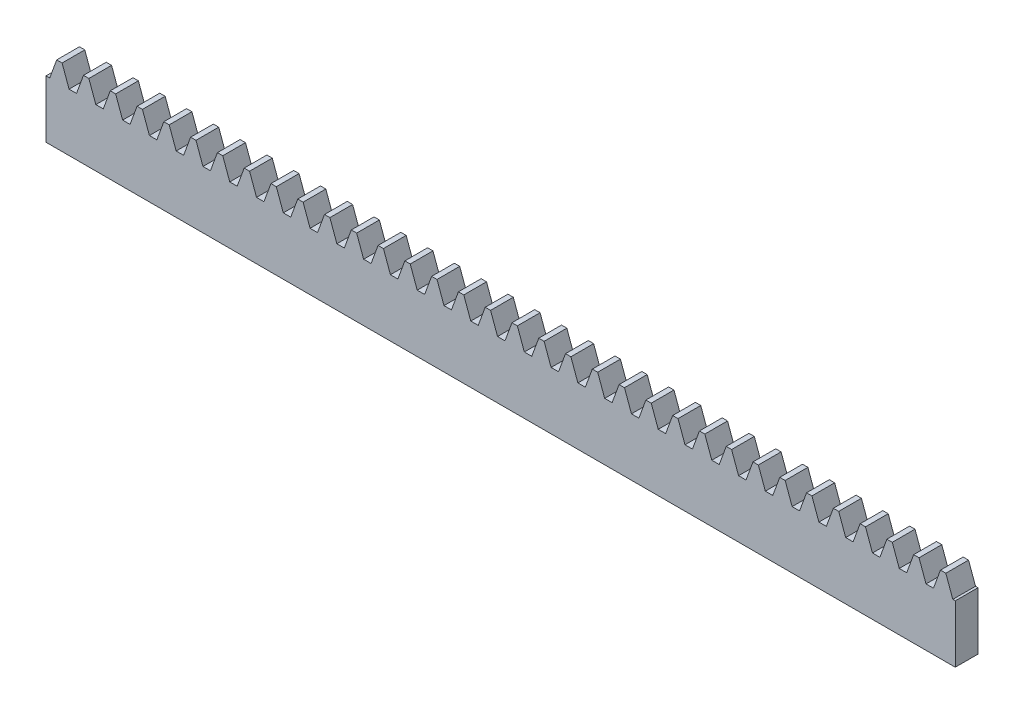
from build123d import *

# Parameters (mm, degrees)
BLANKSKE_W        = 160
BLANKSKE_H        = 13.5
BLANK_DEPTH       = 4
TOOTHCUTSIM_DEPTH = 161.618336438
TEETHCUTS_COUNT   = 35
TEETHCUTS_PITCH   = 4.712388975


with BuildPart() as part:
    # BlankSke → Blank (new body)
    with BuildSketch(Plane.XY):
        with Locations((80, 6.75)):
            Rectangle(BLANKSKE_W, BLANKSKE_H)
    extrude(amount=-BLANK_DEPTH)

    # TooCutSkeSim → ToothCutSim (cut, through all)
    with BuildSketch(Plane.XY):
        Polygon((0.654653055, 10.125), (-0.654653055, 10.125), (-1.892297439, 13.5254), (1.892297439, 13.5254), align=None)
    toothcutsim = extrude(amount=-TOOTHCUTSIM_DEPTH, mode=Mode.SUBTRACT)

    # TeethCuts: ToothCutSim ×35
    with Locations(*[(i * TEETHCUTS_PITCH, 0, 0) for i in range(1, TEETHCUTS_COUNT)]):
        add(toothcutsim, mode=Mode.SUBTRACT)


solid = part.part
